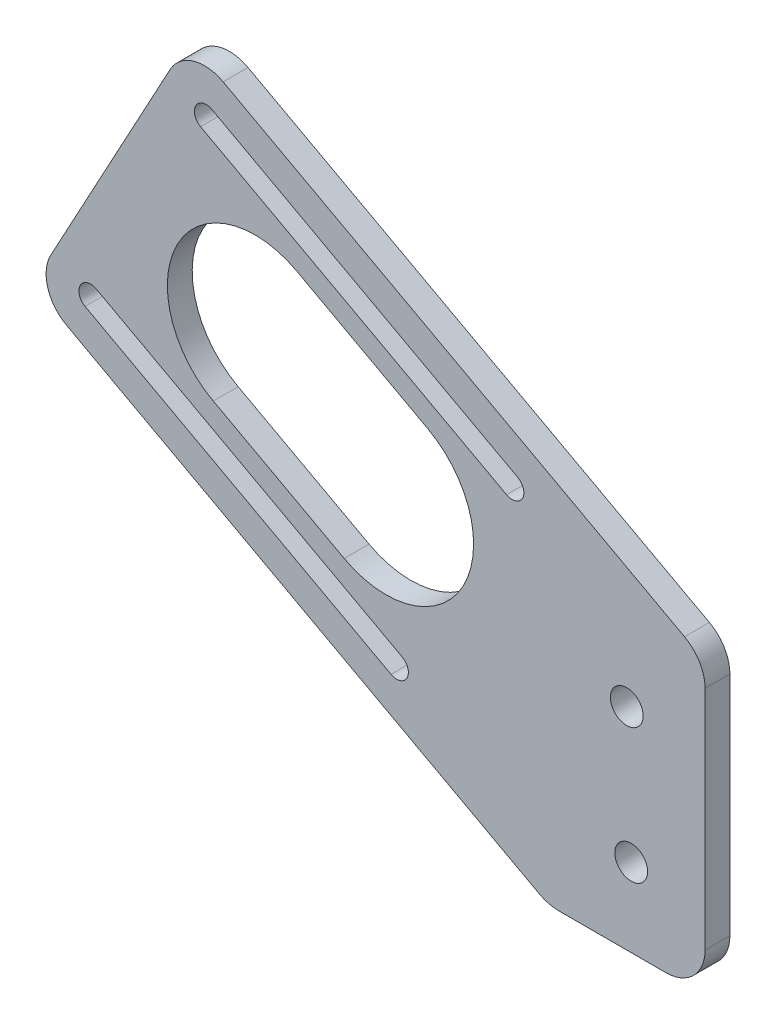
from build123d import *

# Parameters (mm, degrees)
SKETCH1_R           = 2.095
BOSS_EXTRUDE1_DEPTH = 3.175
CUT_EXTRUDE1_DEPTH  = 325.736961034
FILLET1_R           = 5


with BuildPart() as part:
    # Sketch1 → Boss-Extrude1 (new body)
    # profile 1 of 3: a face of its own
    with BuildSketch(Plane.XY):
        Polygon((10, 280), (-10, 280), (-10, 243.067629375), align=None)
        with Locations((0, 270)):
            Circle(SKETCH1_R, mode=Mode.SUBTRACT)
    # profile 2 of 3: a face of its own
    with BuildSketch(Plane.XY):
        Polygon((10, 243.067629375), (-10, 243.067629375), (10, 280), align=None)
        with Locations((0.569659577, 253.067629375)):
            Circle(SKETCH1_R, mode=Mode.SUBTRACT)
    # profile 3 of 3: a face of its own
    with BuildSketch(Plane.XY):
        Polygon((-75.950661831, 278.781915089), (-55.950661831, 315.714285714), (10, 280), (-10, 280), (-10, 243.067629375), align=None)
    extrude(amount=BOSS_EXTRUDE1_DEPTH)

    # Sketch2 → Cut-Extrude1 (cut, through all)
    with BuildSketch(Plane(origin=(0, 0, 0), x_dir=(-1, 0, 0), z_dir=(0, 0, -1))):
        with BuildLine():
            Line((54.441951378, 306.930738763), (15.355192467, 285.764072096))
            ThreePointArc((15.355192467, 285.764072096), (13.321893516, 286.368799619), (13.926621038, 288.40209857))
            Line((13.926621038, 288.40209857), (53.01337995, 309.568765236))
            ThreePointArc((53.01337995, 309.568765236), (55.046678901, 308.964037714), (54.441951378, 306.930738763))
        make_face()
        with BuildLine():
            Line((67.770227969, 282.318496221), (28.683469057, 261.151829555))
            ThreePointArc((28.683469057, 261.151829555), (28.078741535, 259.118530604), (30.112040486, 258.513803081))
            Line((30.112040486, 258.513803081), (69.198799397, 279.680469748))
            ThreePointArc((69.198799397, 279.680469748), (69.80352692, 281.713768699), (67.770227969, 282.318496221))
        make_face()
        with BuildLine():
            Line((52.817809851, 277.399468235), (36.096842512, 268.344556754))
            ThreePointArc((36.096842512, 268.344556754), (20.914877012, 272.859855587), (25.430175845, 288.041821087))
            Line((25.430175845, 288.041821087), (42.151143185, 297.096732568))
            ThreePointArc((42.151143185, 297.096732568), (57.333108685, 292.581433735), (52.817809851, 277.399468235))
        make_face()
    extrude(amount=-CUT_EXTRUDE1_DEPTH, mode=Mode.SUBTRACT)

    # Fillet1
    fillet1_edges = [part.edges().sort_by_distance(p)[0] for p in [
        (10, 243.067629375, 1.5875),
        (-10, 243.067629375, 1.5875),
        (-75.950661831, 278.781915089, 1.5875),
        (-55.950661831, 315.714285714, 1.5875),
        (10, 280, 1.5875),
    ]]
    fillet(fillet1_edges, radius=FILLET1_R)


solid = part.part
